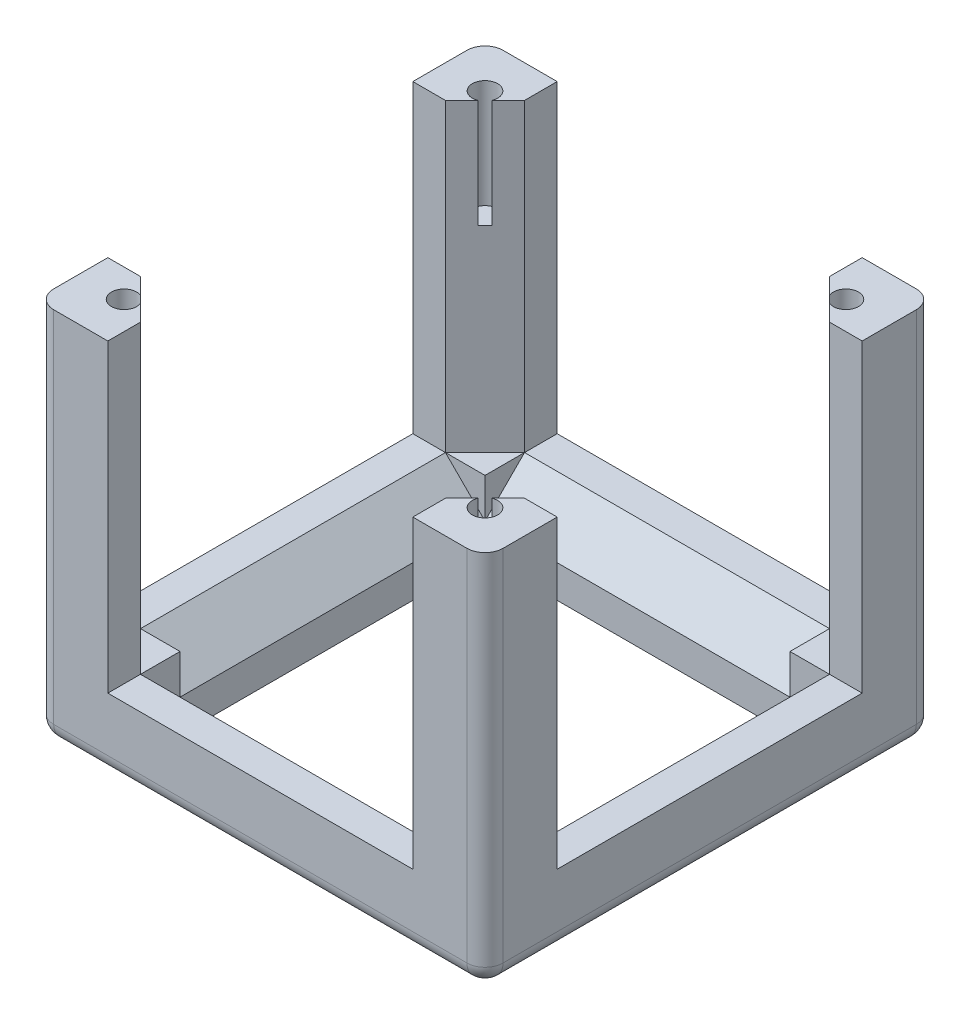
from build123d import *

# Parameters (mm, degrees)
SKIZZE1_W                            = 49.8
SKIZZE1_H                            = 49.8
AUFSATZ_LINEAR_AUSTRAGEN1_DEPTH      = 41.8
SKIZZE2_W                            = 49.8
SKIZZE2_H                            = 33.8
SKIZZE2_W_2                          = 33.8
SKIZZE2_H_2                          = 49.8
SCHNITT_LINEAR_AUSTRAGEN1_DEPTH      = 33.8
SCHNITT_LINEAR_AUSTRAGEN2_DEPTH      = 55.65583226
SCHNITT_LINEAR_AUSTRAGEN2_DEPTH_BACK = 55.65583226
SKIZZE2_3_W                          = 33.8
SKIZZE2_3_H                          = 33.8
VERRUNDUNG1_R                        = 2
SCHNITT_LINEAR_AUSTRAGEN3_DEPTH      = 33.8
SCHNITT_LINEAR_AUSTRAGEN4_DEPTH      = 33.8
SCHNITT_LINEAR_AUSTRAGEN5_DEPTH      = 33.8
SKIZZE6_R                            = 1.4
SCHNITT_LINEAR_AUSTRAGEN6_DEPTH      = 12


with BuildPart() as part:
    # Skizze1 → Aufsatz-Linear austragen1 (new body)
    with BuildSketch(Plane(origin=(0, 0, 0), x_dir=(1, 0, 0), z_dir=(0, 1, 0))):
        Rectangle(SKIZZE1_W, SKIZZE1_H)
    extrude(amount=AUFSATZ_LINEAR_AUSTRAGEN1_DEPTH)

    # Skizze2 → Schnitt-Linear austragen1 (cut)
    with BuildSketch(Plane(origin=(0, 41.8, 0), x_dir=(1, 0, 0), z_dir=(0, 1, 0))):
        Rectangle(SKIZZE2_W, SKIZZE2_H)
        Rectangle(SKIZZE2_W_2, SKIZZE2_H_2)
    extrude(amount=-SCHNITT_LINEAR_AUSTRAGEN1_DEPTH, mode=Mode.SUBTRACT)

    # Skizze2_3 → Schnitt-Linear austragen2 (cut, two sides: drawn at the far end of the back side and taken through both)
    with BuildSketch(Plane(origin=(0, 41.8, 0), x_dir=(1, 0, 0), z_dir=(0, 1, 0)).offset(-SCHNITT_LINEAR_AUSTRAGEN2_DEPTH_BACK)):
        Rectangle(SKIZZE2_3_W, SKIZZE2_3_H)
    extrude(amount=SCHNITT_LINEAR_AUSTRAGEN2_DEPTH + SCHNITT_LINEAR_AUSTRAGEN2_DEPTH_BACK, mode=Mode.SUBTRACT)

    # Verrundung1
    verrundung1_edges = [part.edges().sort_by_distance(p)[0] for p in [
        (0, 0, -24.9),
        (24.9, 0, 0),
        (0, 0, 24.9),
        (-24.9, 0, 0),
        (-24.9, 20.9, -24.9),
        (24.9, 20.9, -24.9),
        (24.9, 20.9, 24.9),
        (-24.9, 20.9, 24.9),
    ]]
    fillet(verrundung1_edges, radius=VERRUNDUNG1_R)

    # Skizze3 → Schnitt-Linear austragen3 (cut)
    with BuildSketch(Plane(origin=(0, 8, 0), x_dir=(1, 0, 0), z_dir=(0, 1, 0))):
        Polygon((-16.9, 16.9), (-16.9, 21.284062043), (-21.284062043, 16.9), align=None)
        Polygon((16.9, 16.9), (21.284062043, 16.9), (16.9, 21.284062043), align=None)
        Polygon((16.9, -16.9), (16.9, -21.284062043), (21.284062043, -16.9), align=None)
        Polygon((-16.9, -16.9), (-21.284062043, -16.9), (-16.9, -21.284062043), align=None)
    extrude(amount=SCHNITT_LINEAR_AUSTRAGEN3_DEPTH, mode=Mode.SUBTRACT)

    # Skizze4 → Schnitt-Linear austragen4 (cut)
    with BuildSketch(Plane.XY.offset(-16.9)):
        Polygon((-16.9, 8), (-16.9, 3.615937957), (-21.284062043, 8), align=None)
        Polygon((21.284062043, 8), (16.9, 8), (16.9, 3.615937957), align=None)
    extrude(amount=SCHNITT_LINEAR_AUSTRAGEN4_DEPTH, mode=Mode.SUBTRACT)

    # Skizze5 → Schnitt-Linear austragen5 (cut)
    with BuildSketch(Plane(origin=(-16.9, 0, 0), x_dir=(0, 0, -1), z_dir=(1, 0, 0))):
        Polygon((-16.9, 8), (-16.9, 3.615937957), (-21.284062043, 8), align=None)
        Polygon((21.284062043, 8), (16.9, 8), (16.9, 3.615937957), align=None)
    extrude(amount=SCHNITT_LINEAR_AUSTRAGEN5_DEPTH, mode=Mode.SUBTRACT)

    # Skizze6 → Schnitt-Linear austragen6 (cut)
    with BuildSketch(Plane(origin=(0, 41.8, 0), x_dir=(1, 0, 0), z_dir=(0, 1, 0))):
        with Locations((-20, 20)):
            Circle(SKIZZE6_R)
        with Locations((20, 20)):
            Circle(SKIZZE6_R)
        with Locations((20, -20)):
            Circle(SKIZZE6_R)
        with Locations((-20, -20)):
            Circle(SKIZZE6_R)
    extrude(amount=-SCHNITT_LINEAR_AUSTRAGEN6_DEPTH, mode=Mode.SUBTRACT)


solid = part.part
